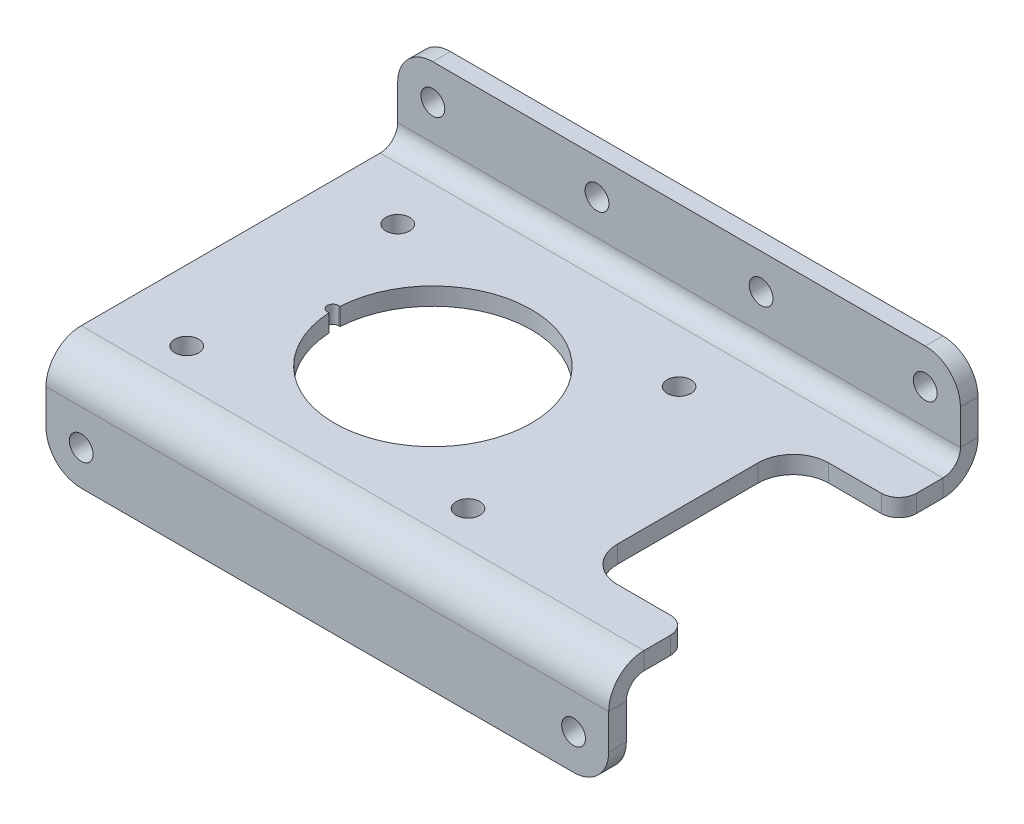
ISO-10303-21;
HEADER;
FILE_DESCRIPTION(('STEP AP214'),'2;1');
FILE_NAME('part.step','',(''),(''),'','','');
FILE_SCHEMA(('AUTOMOTIVE_DESIGN { 1 0 10303 214 1 1 1 1 }'));
ENDSEC;
DATA;
#1=APPLICATION_CONTEXT('core data for automotive mechanical design processes');
#2=APPLICATION_PROTOCOL_DEFINITION('international standard','automotive_design',2000,#1);
#3=PRODUCT_CONTEXT('',#1,'mechanical');
#4=PRODUCT('Part','Part','',(#3));
#5=PRODUCT_RELATED_PRODUCT_CATEGORY('part','',(#4));
#6=PRODUCT_DEFINITION_FORMATION('','',#4);
#7=PRODUCT_DEFINITION_CONTEXT('part definition',#1,'design');
#8=PRODUCT_DEFINITION('design','',#6,#7);
#9=PRODUCT_DEFINITION_SHAPE('','',#8);
#10=(LENGTH_UNIT() NAMED_UNIT(*) SI_UNIT(.MILLI.,.METRE.));
#11=(NAMED_UNIT(*) PLANE_ANGLE_UNIT() SI_UNIT($,.RADIAN.));
#12=(NAMED_UNIT(*) SI_UNIT($,.STERADIAN.) SOLID_ANGLE_UNIT());
#13=UNCERTAINTY_MEASURE_WITH_UNIT(LENGTH_MEASURE(1.E-05),#10,'distance_accuracy_value','');
#14=(GEOMETRIC_REPRESENTATION_CONTEXT(3) GLOBAL_UNCERTAINTY_ASSIGNED_CONTEXT((#13)) GLOBAL_UNIT_ASSIGNED_CONTEXT((#10,
#11,#12)) REPRESENTATION_CONTEXT('',''));
#15=CARTESIAN_POINT('',(0.,0.,0.));
#16=DIRECTION('',(0.,0.,1.));
#17=DIRECTION('',(1.,0.,0.));
#18=AXIS2_PLACEMENT_3D('',#15,#16,#17);
#19=CARTESIAN_POINT('',(101.6,-3.175,-31.75));
#20=DIRECTION('',(1.,0.,0.));
#21=DIRECTION('',(0.,0.,-1.));
#22=AXIS2_PLACEMENT_3D('',#19,#20,#21);
#23=PLANE('',#22);
#24=DIRECTION('',(0.,0.,-1.));
#25=VECTOR('',#24,1.);
#26=CARTESIAN_POINT('',(101.6,-3.175,-31.75));
#27=LINE('',#26,#25);
#28=CARTESIAN_POINT('',(101.6,-3.17500000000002,25.4));
#29=VERTEX_POINT('',#28);
#30=CARTESIAN_POINT('',(101.6,-3.175,20.6375));
#31=VERTEX_POINT('',#30);
#32=EDGE_CURVE('E492',#29,#31,#27,.T.);
#33=ORIENTED_EDGE('',*,*,#32,.T.);
#34=DIRECTION('',(0.,-1.,0.));
#35=VECTOR('',#34,1.);
#36=CARTESIAN_POINT('',(101.6,0.,20.6375));
#37=LINE('',#36,#35);
#38=CARTESIAN_POINT('',(101.6,0.,20.6375));
#39=VERTEX_POINT('',#38);
#40=EDGE_CURVE('E542',#31,#39,#37,.F.);
#41=ORIENTED_EDGE('',*,*,#40,.T.);
#42=DIRECTION('',(0.,0.,-1.));
#43=VECTOR('',#42,1.);
#44=CARTESIAN_POINT('',(101.6,0.,-31.75));
#45=LINE('',#44,#43);
#46=CARTESIAN_POINT('',(101.6,0.,25.4));
#47=VERTEX_POINT('',#46);
#48=EDGE_CURVE('E491',#47,#39,#45,.T.);
#49=ORIENTED_EDGE('',*,*,#48,.F.);
#50=DIRECTION('',(0.,1.,0.));
#51=VECTOR('',#50,1.);
#52=CARTESIAN_POINT('',(101.6,-3.17500000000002,25.4));
#53=LINE('',#52,#51);
#54=EDGE_CURVE('E398',#29,#47,#53,.T.);
#55=ORIENTED_EDGE('',*,*,#54,.F.);
#56=EDGE_LOOP('',(#33,#41,#49,#55));
#57=FACE_BOUND('',#56,.T.);
#58=ADVANCED_FACE('F60',(#57),#23,.T.);
#59=CARTESIAN_POINT('',(0.,-3.175,0.));
#60=DIRECTION('',(0.,1.,0.));
#61=DIRECTION('',(0.,0.,1.));
#62=AXIS2_PLACEMENT_3D('',#59,#60,#61);
#63=PLANE('',#62);
#64=CARTESIAN_POINT('',(12.7,-3.175,19.049999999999));
#65=DIRECTION('',(0.,-1.,0.));
#66=DIRECTION('',(0.,0.,-1.));
#67=AXIS2_PLACEMENT_3D('',#64,#65,#66);
#68=CIRCLE('',#67,2.14999999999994);
#69=CARTESIAN_POINT('',(12.7,-3.175,16.8999999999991));
#70=VERTEX_POINT('',#69);
#71=EDGE_CURVE('E311',#70,#70,#68,.T.);
#72=ORIENTED_EDGE('',*,*,#71,.F.);
#73=EDGE_LOOP('',(#72));
#74=FACE_BOUND('',#73,.T.);
#75=DIRECTION('',(-1.,0.,0.));
#76=VECTOR('',#75,1.);
#77=CARTESIAN_POINT('',(20.3481437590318,-3.175,-1.));
#78=LINE('',#77,#76);
#79=CARTESIAN_POINT('',(20.3481437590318,-3.175,-1.));
#80=VERTEX_POINT('',#79);
#81=CARTESIAN_POINT('',(20.05,-3.175,-1.));
#82=VERTEX_POINT('',#81);
#83=EDGE_CURVE('E465',#80,#82,#78,.T.);
#84=ORIENTED_EDGE('',*,*,#83,.T.);
#85=CARTESIAN_POINT('',(20.05,-3.175,0.));
#86=DIRECTION('',(0.,1.,0.));
#87=DIRECTION('',(0.,0.,1.));
#88=AXIS2_PLACEMENT_3D('',#85,#86,#87);
#89=CIRCLE('',#88,1.);
#90=CARTESIAN_POINT('',(20.05,-3.175,1.));
#91=VERTEX_POINT('',#90);
#92=EDGE_CURVE('E455',#82,#91,#89,.T.);
#93=ORIENTED_EDGE('',*,*,#92,.T.);
#94=DIRECTION('',(1.,0.,0.));
#95=VECTOR('',#94,1.);
#96=CARTESIAN_POINT('',(20.3481437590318,-3.175,0.999999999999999));
#97=LINE('',#96,#95);
#98=CARTESIAN_POINT('',(20.3481437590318,-3.175,0.999999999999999));
#99=VERTEX_POINT('',#98);
#100=EDGE_CURVE('E458',#91,#99,#97,.T.);
#101=ORIENTED_EDGE('',*,*,#100,.T.);
#102=CARTESIAN_POINT('',(38.1,-3.175,0.));
#103=DIRECTION('',(0.,1.,0.));
#104=DIRECTION('',(0.,0.,1.));
#105=AXIS2_PLACEMENT_3D('',#102,#103,#104);
#106=CIRCLE('',#105,17.78);
#107=EDGE_CURVE('E462',#99,#80,#106,.T.);
#108=ORIENTED_EDGE('',*,*,#107,.T.);
#109=EDGE_LOOP('',(#84,#93,#101,#108));
#110=FACE_BOUND('',#109,.T.);
#111=DIRECTION('',(1.,0.,0.));
#112=VECTOR('',#111,1.);
#113=CARTESIAN_POINT('',(0.,-3.175,17.4625));
#114=LINE('',#113,#112);
#115=CARTESIAN_POINT('',(88.9,-3.175,17.4625));
#116=VERTEX_POINT('',#115);
#117=CARTESIAN_POINT('',(98.425,-3.175,17.4625));
#118=VERTEX_POINT('',#117);
#119=EDGE_CURVE('E283',#116,#118,#114,.T.);
#120=ORIENTED_EDGE('',*,*,#119,.T.);
#121=CARTESIAN_POINT('',(98.425,-3.175,20.6375));
#122=DIRECTION('',(0.,1.,0.));
#123=DIRECTION('',(0.,0.,1.));
#124=AXIS2_PLACEMENT_3D('',#121,#122,#123);
#125=CIRCLE('',#124,3.175);
#126=EDGE_CURVE('E540',#118,#31,#125,.F.);
#127=ORIENTED_EDGE('',*,*,#126,.T.);
#128=ORIENTED_EDGE('',*,*,#32,.F.);
#129=DIRECTION('',(-1.,0.,0.));
#130=VECTOR('',#129,1.);
#131=CARTESIAN_POINT('',(0.,-3.17500000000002,25.4));
#132=LINE('',#131,#130);
#133=CARTESIAN_POINT('',(0.,-3.17500000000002,25.4));
#134=VERTEX_POINT('',#133);
#135=EDGE_CURVE('E394',#134,#29,#132,.F.);
#136=ORIENTED_EDGE('',*,*,#135,.F.);
#137=DIRECTION('',(0.,0.,1.));
#138=VECTOR('',#137,1.);
#139=CARTESIAN_POINT('',(0.,-3.175,-31.75));
#140=LINE('',#139,#138);
#141=CARTESIAN_POINT('',(0.,-3.17500000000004,-28.575));
#142=VERTEX_POINT('',#141);
#143=EDGE_CURVE('E487',#142,#134,#140,.T.);
#144=ORIENTED_EDGE('',*,*,#143,.F.);
#145=DIRECTION('',(-1.,0.,0.));
#146=VECTOR('',#145,1.);
#147=CARTESIAN_POINT('',(0.,-3.17500000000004,-28.575));
#148=LINE('',#147,#146);
#149=CARTESIAN_POINT('',(101.6,-3.175,-28.575));
#150=VERTEX_POINT('',#149);
#151=EDGE_CURVE('E431',#142,#150,#148,.F.);
#152=ORIENTED_EDGE('',*,*,#151,.T.);
#153=CARTESIAN_POINT('',(101.6,-3.175,-23.8125));
#154=VERTEX_POINT('',#153);
#155=EDGE_CURVE('E490',#154,#150,#27,.T.);
#156=ORIENTED_EDGE('',*,*,#155,.F.);
#157=CARTESIAN_POINT('',(98.425,-3.175,-23.8125));
#158=DIRECTION('',(0.,1.,0.));
#159=DIRECTION('',(0.,0.,1.));
#160=AXIS2_PLACEMENT_3D('',#157,#158,#159);
#161=CIRCLE('',#160,3.175);
#162=CARTESIAN_POINT('',(98.425,-3.175,-20.6375));
#163=VERTEX_POINT('',#162);
#164=EDGE_CURVE('E538',#154,#163,#161,.F.);
#165=ORIENTED_EDGE('',*,*,#164,.T.);
#166=DIRECTION('',(-1.,0.,0.));
#167=VECTOR('',#166,1.);
#168=CARTESIAN_POINT('',(0.,-3.175,-20.6375));
#169=LINE('',#168,#167);
#170=CARTESIAN_POINT('',(88.9,-3.175,-20.6375));
#171=VERTEX_POINT('',#170);
#172=EDGE_CURVE('E278',#163,#171,#169,.T.);
#173=ORIENTED_EDGE('',*,*,#172,.T.);
#174=CARTESIAN_POINT('',(88.9,-3.175,-14.2875));
#175=DIRECTION('',(0.,1.,0.));
#176=DIRECTION('',(0.,0.,1.));
#177=AXIS2_PLACEMENT_3D('',#174,#175,#176);
#178=CIRCLE('',#177,6.35);
#179=CARTESIAN_POINT('',(82.55,-3.175,-14.2875));
#180=VERTEX_POINT('',#179);
#181=EDGE_CURVE('E258',#171,#180,#178,.T.);
#182=ORIENTED_EDGE('',*,*,#181,.T.);
#183=DIRECTION('',(0.,0.,1.));
#184=VECTOR('',#183,1.);
#185=CARTESIAN_POINT('',(82.55,-3.175,0.));
#186=LINE('',#185,#184);
#187=CARTESIAN_POINT('',(82.55,-3.175,11.1125));
#188=VERTEX_POINT('',#187);
#189=EDGE_CURVE('E287',#180,#188,#186,.T.);
#190=ORIENTED_EDGE('',*,*,#189,.T.);
#191=CARTESIAN_POINT('',(88.9,-3.175,11.1125));
#192=DIRECTION('',(0.,1.,0.));
#193=DIRECTION('',(0.,0.,1.));
#194=AXIS2_PLACEMENT_3D('',#191,#192,#193);
#195=CIRCLE('',#194,6.35);
#196=EDGE_CURVE('E290',#188,#116,#195,.T.);
#197=ORIENTED_EDGE('',*,*,#196,.T.);
#198=EDGE_LOOP('',(#120,#127,#128,#136,#144,#152,#156,#165,#173,#182,#190,#197));
#199=FACE_BOUND('',#198,.T.);
#200=CARTESIAN_POINT('',(63.5,-3.175,19.049999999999));
#201=DIRECTION('',(0.,-1.,0.));
#202=DIRECTION('',(0.,0.,-1.));
#203=AXIS2_PLACEMENT_3D('',#200,#201,#202);
#204=CIRCLE('',#203,2.14999999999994);
#205=CARTESIAN_POINT('',(63.5,-3.175,16.8999999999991));
#206=VERTEX_POINT('',#205);
#207=EDGE_CURVE('E305',#206,#206,#204,.T.);
#208=ORIENTED_EDGE('',*,*,#207,.F.);
#209=EDGE_LOOP('',(#208));
#210=FACE_BOUND('',#209,.T.);
#211=CARTESIAN_POINT('',(63.5,-3.175,-19.049999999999));
#212=DIRECTION('',(0.,-1.,0.));
#213=DIRECTION('',(0.,0.,-1.));
#214=AXIS2_PLACEMENT_3D('',#211,#212,#213);
#215=CIRCLE('',#214,2.14999999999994);
#216=CARTESIAN_POINT('',(63.5,-3.175,-21.1999999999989));
#217=VERTEX_POINT('',#216);
#218=EDGE_CURVE('E299',#217,#217,#215,.T.);
#219=ORIENTED_EDGE('',*,*,#218,.F.);
#220=EDGE_LOOP('',(#219));
#221=FACE_BOUND('',#220,.T.);
#222=CARTESIAN_POINT('',(12.7,-3.175,-19.049999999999));
#223=DIRECTION('',(0.,-1.,0.));
#224=DIRECTION('',(0.,0.,-1.));
#225=AXIS2_PLACEMENT_3D('',#222,#223,#224);
#226=CIRCLE('',#225,2.14999999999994);
#227=CARTESIAN_POINT('',(12.7,-3.175,-21.1999999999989));
#228=VERTEX_POINT('',#227);
#229=EDGE_CURVE('E293',#228,#228,#226,.T.);
#230=ORIENTED_EDGE('',*,*,#229,.F.);
#231=EDGE_LOOP('',(#230));
#232=FACE_BOUND('',#231,.T.);
#233=ADVANCED_FACE('F558',(#74,#110,#199,#210,#221,#232),#63,.F.);
#234=CARTESIAN_POINT('',(0.,-1.22107755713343E-13,-34.925));
#235=DIRECTION('',(0.,0.,1.));
#236=DIRECTION('',(0.,-1.,0.));
#237=AXIS2_PLACEMENT_3D('',#234,#235,#236);
#238=PLANE('',#237);
#239=CARTESIAN_POINT('',(95.25,9.525,-34.925));
#240=DIRECTION('',(0.,0.,-1.));
#241=DIRECTION('',(0.,1.,0.));
#242=AXIS2_PLACEMENT_3D('',#239,#240,#241);
#243=CIRCLE('',#242,2.14999999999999);
#244=CARTESIAN_POINT('',(95.25,11.675,-34.925));
#245=VERTEX_POINT('',#244);
#246=EDGE_CURVE('E317',#245,#245,#243,.T.);
#247=ORIENTED_EDGE('',*,*,#246,.F.);
#248=EDGE_LOOP('',(#247));
#249=FACE_BOUND('',#248,.T.);
#250=CARTESIAN_POINT('',(35.9833333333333,9.525,-34.925));
#251=DIRECTION('',(0.,0.,-1.));
#252=DIRECTION('',(0.,1.,0.));
#253=AXIS2_PLACEMENT_3D('',#250,#251,#252);
#254=CIRCLE('',#253,2.14999999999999);
#255=CARTESIAN_POINT('',(35.9833333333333,11.675,-34.925));
#256=VERTEX_POINT('',#255);
#257=EDGE_CURVE('E335',#256,#256,#254,.T.);
#258=ORIENTED_EDGE('',*,*,#257,.F.);
#259=EDGE_LOOP('',(#258));
#260=FACE_BOUND('',#259,.T.);
#261=DIRECTION('',(1.,0.,0.));
#262=VECTOR('',#261,1.);
#263=CARTESIAN_POINT('',(101.6,15.875,-34.9250000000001));
#264=LINE('',#263,#262);
#265=CARTESIAN_POINT('',(6.34999999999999,15.875,-34.9250000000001));
#266=VERTEX_POINT('',#265);
#267=CARTESIAN_POINT('',(95.25,15.875,-34.9250000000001));
#268=VERTEX_POINT('',#267);
#269=EDGE_CURVE('E421',#266,#268,#264,.T.);
#270=ORIENTED_EDGE('',*,*,#269,.T.);
#271=CARTESIAN_POINT('',(95.25,9.525,-34.925));
#272=DIRECTION('',(0.,0.,1.));
#273=DIRECTION('',(0.,-1.,0.));
#274=AXIS2_PLACEMENT_3D('',#271,#272,#273);
#275=CIRCLE('',#274,6.35);
#276=CARTESIAN_POINT('',(101.6,9.525,-34.925));
#277=VERTEX_POINT('',#276);
#278=EDGE_CURVE('E531',#268,#277,#275,.F.);
#279=ORIENTED_EDGE('',*,*,#278,.T.);
#280=DIRECTION('',(0.,-1.,0.));
#281=VECTOR('',#280,1.);
#282=CARTESIAN_POINT('',(101.6,0.,-34.925));
#283=LINE('',#282,#281);
#284=CARTESIAN_POINT('',(101.6,3.17499999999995,-34.925));
#285=VERTEX_POINT('',#284);
#286=EDGE_CURVE('E415',#277,#285,#283,.T.);
#287=ORIENTED_EDGE('',*,*,#286,.T.);
#288=DIRECTION('',(1.,0.,0.));
#289=VECTOR('',#288,1.);
#290=CARTESIAN_POINT('',(0.,3.17500000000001,-34.925));
#291=LINE('',#290,#289);
#292=CARTESIAN_POINT('',(0.,3.17500000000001,-34.925));
#293=VERTEX_POINT('',#292);
#294=EDGE_CURVE('E409',#293,#285,#291,.T.);
#295=ORIENTED_EDGE('',*,*,#294,.F.);
#296=DIRECTION('',(0.,1.,0.));
#297=VECTOR('',#296,1.);
#298=CARTESIAN_POINT('',(0.,15.875,-34.9250000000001));
#299=LINE('',#298,#297);
#300=CARTESIAN_POINT('',(0.,9.525,-34.925));
#301=VERTEX_POINT('',#300);
#302=EDGE_CURVE('E417',#293,#301,#299,.T.);
#303=ORIENTED_EDGE('',*,*,#302,.T.);
#304=CARTESIAN_POINT('',(6.34999999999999,9.525,-34.925));
#305=DIRECTION('',(0.,0.,1.));
#306=DIRECTION('',(0.,-1.,0.));
#307=AXIS2_PLACEMENT_3D('',#304,#305,#306);
#308=CIRCLE('',#307,6.35);
#309=EDGE_CURVE('E529',#301,#266,#308,.F.);
#310=ORIENTED_EDGE('',*,*,#309,.T.);
#311=EDGE_LOOP('',(#270,#279,#287,#295,#303,#310));
#312=FACE_BOUND('',#311,.T.);
#313=CARTESIAN_POINT('',(65.6166666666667,9.525,-34.925));
#314=DIRECTION('',(0.,0.,-1.));
#315=DIRECTION('',(0.,1.,0.));
#316=AXIS2_PLACEMENT_3D('',#313,#314,#315);
#317=CIRCLE('',#316,2.14999999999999);
#318=CARTESIAN_POINT('',(65.6166666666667,11.675,-34.925));
#319=VERTEX_POINT('',#318);
#320=EDGE_CURVE('E329',#319,#319,#317,.T.);
#321=ORIENTED_EDGE('',*,*,#320,.F.);
#322=EDGE_LOOP('',(#321));
#323=FACE_BOUND('',#322,.T.);
#324=CARTESIAN_POINT('',(6.34999999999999,9.525,-34.925));
#325=DIRECTION('',(0.,0.,-1.));
#326=DIRECTION('',(0.,1.,0.));
#327=AXIS2_PLACEMENT_3D('',#324,#325,#326);
#328=CIRCLE('',#327,2.14999999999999);
#329=CARTESIAN_POINT('',(6.34999999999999,11.675,-34.925));
#330=VERTEX_POINT('',#329);
#331=EDGE_CURVE('E323',#330,#330,#328,.T.);
#332=ORIENTED_EDGE('',*,*,#331,.F.);
#333=EDGE_LOOP('',(#332));
#334=FACE_BOUND('',#333,.T.);
#335=ADVANCED_FACE('F616',(#249,#260,#312,#323,#334),#238,.F.);
#336=CARTESIAN_POINT('',(0.,-3.175,-31.75));
#337=DIRECTION('',(-1.,0.,0.));
#338=DIRECTION('',(0.,0.,1.));
#339=AXIS2_PLACEMENT_3D('',#336,#337,#338);
#340=PLANE('',#339);
#341=ORIENTED_EDGE('',*,*,#143,.T.);
#342=DIRECTION('',(0.,1.,0.));
#343=VECTOR('',#342,1.);
#344=CARTESIAN_POINT('',(0.,-3.17500000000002,25.4));
#345=LINE('',#344,#343);
#346=CARTESIAN_POINT('',(0.,0.,25.4));
#347=VERTEX_POINT('',#346);
#348=EDGE_CURVE('E388',#134,#347,#345,.T.);
#349=ORIENTED_EDGE('',*,*,#348,.T.);
#350=DIRECTION('',(0.,0.,1.));
#351=VECTOR('',#350,1.);
#352=CARTESIAN_POINT('',(0.,0.,-31.75));
#353=LINE('',#352,#351);
#354=CARTESIAN_POINT('',(0.,0.,-28.575));
#355=VERTEX_POINT('',#354);
#356=EDGE_CURVE('E480',#355,#347,#353,.T.);
#357=ORIENTED_EDGE('',*,*,#356,.F.);
#358=DIRECTION('',(0.,-1.,0.));
#359=VECTOR('',#358,1.);
#360=CARTESIAN_POINT('',(0.,0.,-28.575));
#361=LINE('',#360,#359);
#362=EDGE_CURVE('E438',#355,#142,#361,.T.);
#363=ORIENTED_EDGE('',*,*,#362,.T.);
#364=EDGE_LOOP('',(#341,#349,#357,#363));
#365=FACE_BOUND('',#364,.T.);
#366=ADVANCED_FACE('F631',(#365),#340,.T.);
#367=CARTESIAN_POINT('',(0.,0.,0.));
#368=DIRECTION('',(0.,1.,0.));
#369=DIRECTION('',(0.,0.,1.));
#370=AXIS2_PLACEMENT_3D('',#367,#368,#369);
#371=PLANE('',#370);
#372=ORIENTED_EDGE('',*,*,#48,.T.);
#373=CARTESIAN_POINT('',(98.425,0.,20.6375));
#374=DIRECTION('',(0.,1.,0.));
#375=DIRECTION('',(0.,0.,1.));
#376=AXIS2_PLACEMENT_3D('',#373,#374,#375);
#377=CIRCLE('',#376,3.175);
#378=CARTESIAN_POINT('',(98.425,0.,17.4625));
#379=VERTEX_POINT('',#378);
#380=EDGE_CURVE('E545',#39,#379,#377,.T.);
#381=ORIENTED_EDGE('',*,*,#380,.T.);
#382=DIRECTION('',(1.,0.,0.));
#383=VECTOR('',#382,1.);
#384=CARTESIAN_POINT('',(101.6,0.,17.4625));
#385=LINE('',#384,#383);
#386=CARTESIAN_POINT('',(88.9,0.,17.4625));
#387=VERTEX_POINT('',#386);
#388=EDGE_CURVE('E260',#387,#379,#385,.T.);
#389=ORIENTED_EDGE('',*,*,#388,.F.);
#390=CARTESIAN_POINT('',(88.9,0.,11.1125));
#391=DIRECTION('',(0.,1.,0.));
#392=DIRECTION('',(1.,0.,0.));
#393=AXIS2_PLACEMENT_3D('',#390,#391,#392);
#394=CIRCLE('',#393,6.35);
#395=CARTESIAN_POINT('',(82.55,0.,11.1125));
#396=VERTEX_POINT('',#395);
#397=EDGE_CURVE('E269',#396,#387,#394,.T.);
#398=ORIENTED_EDGE('',*,*,#397,.F.);
#399=DIRECTION('',(0.,0.,1.));
#400=VECTOR('',#399,1.);
#401=CARTESIAN_POINT('',(82.55,0.,-14.2875));
#402=LINE('',#401,#400);
#403=CARTESIAN_POINT('',(82.55,0.,-14.2875));
#404=VERTEX_POINT('',#403);
#405=EDGE_CURVE('E267',#404,#396,#402,.T.);
#406=ORIENTED_EDGE('',*,*,#405,.F.);
#407=CARTESIAN_POINT('',(88.9,0.,-14.2875));
#408=DIRECTION('',(0.,1.,0.));
#409=DIRECTION('',(-1.,0.,0.));
#410=AXIS2_PLACEMENT_3D('',#407,#408,#409);
#411=CIRCLE('',#410,6.35);
#412=CARTESIAN_POINT('',(88.9,0.,-20.6375));
#413=VERTEX_POINT('',#412);
#414=EDGE_CURVE('E249',#413,#404,#411,.T.);
#415=ORIENTED_EDGE('',*,*,#414,.F.);
#416=DIRECTION('',(-1.,0.,0.));
#417=VECTOR('',#416,1.);
#418=CARTESIAN_POINT('',(101.6,0.,-20.6375));
#419=LINE('',#418,#417);
#420=CARTESIAN_POINT('',(98.425,0.,-20.6375));
#421=VERTEX_POINT('',#420);
#422=EDGE_CURVE('E243',#421,#413,#419,.T.);
#423=ORIENTED_EDGE('',*,*,#422,.F.);
#424=CARTESIAN_POINT('',(98.425,0.,-23.8125));
#425=DIRECTION('',(0.,1.,0.));
#426=DIRECTION('',(0.,0.,1.));
#427=AXIS2_PLACEMENT_3D('',#424,#425,#426);
#428=CIRCLE('',#427,3.175);
#429=CARTESIAN_POINT('',(101.6,0.,-23.8125));
#430=VERTEX_POINT('',#429);
#431=EDGE_CURVE('E75',#421,#430,#428,.T.);
#432=ORIENTED_EDGE('',*,*,#431,.T.);
#433=CARTESIAN_POINT('',(101.6,0.,-28.575));
#434=VERTEX_POINT('',#433);
#435=EDGE_CURVE('E498',#430,#434,#45,.T.);
#436=ORIENTED_EDGE('',*,*,#435,.T.);
#437=DIRECTION('',(-1.,0.,0.));
#438=VECTOR('',#437,1.);
#439=CARTESIAN_POINT('',(0.,0.,-28.575));
#440=LINE('',#439,#438);
#441=EDGE_CURVE('E444',#355,#434,#440,.F.);
#442=ORIENTED_EDGE('',*,*,#441,.F.);
#443=ORIENTED_EDGE('',*,*,#356,.T.);
#444=DIRECTION('',(-1.,0.,0.));
#445=VECTOR('',#444,1.);
#446=CARTESIAN_POINT('',(0.,0.,25.4));
#447=LINE('',#446,#445);
#448=EDGE_CURVE('E381',#347,#47,#447,.F.);
#449=ORIENTED_EDGE('',*,*,#448,.T.);
#450=EDGE_LOOP('',(#372,#381,#389,#398,#406,#415,#423,#432,#436,#442,#443,#449));
#451=FACE_BOUND('',#450,.T.);
#452=CARTESIAN_POINT('',(12.7,0.,-19.049999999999));
#453=DIRECTION('',(0.,1.,0.));
#454=DIRECTION('',(0.,0.,1.));
#455=AXIS2_PLACEMENT_3D('',#452,#453,#454);
#456=CIRCLE('',#455,2.14999999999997);
#457=CARTESIAN_POINT('',(12.7,0.,-16.899999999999));
#458=VERTEX_POINT('',#457);
#459=EDGE_CURVE('E296',#458,#458,#456,.T.);
#460=ORIENTED_EDGE('',*,*,#459,.F.);
#461=EDGE_LOOP('',(#460));
#462=FACE_BOUND('',#461,.T.);
#463=CARTESIAN_POINT('',(63.5,0.,-19.049999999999));
#464=DIRECTION('',(0.,1.,0.));
#465=DIRECTION('',(0.,0.,1.));
#466=AXIS2_PLACEMENT_3D('',#463,#464,#465);
#467=CIRCLE('',#466,2.14999999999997);
#468=CARTESIAN_POINT('',(63.5,0.,-16.899999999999));
#469=VERTEX_POINT('',#468);
#470=EDGE_CURVE('E302',#469,#469,#467,.T.);
#471=ORIENTED_EDGE('',*,*,#470,.F.);
#472=EDGE_LOOP('',(#471));
#473=FACE_BOUND('',#472,.T.);
#474=CARTESIAN_POINT('',(63.5,0.,19.049999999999));
#475=DIRECTION('',(0.,1.,0.));
#476=DIRECTION('',(0.,0.,1.));
#477=AXIS2_PLACEMENT_3D('',#474,#475,#476);
#478=CIRCLE('',#477,2.14999999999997);
#479=CARTESIAN_POINT('',(63.5,0.,21.199999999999));
#480=VERTEX_POINT('',#479);
#481=EDGE_CURVE('E308',#480,#480,#478,.T.);
#482=ORIENTED_EDGE('',*,*,#481,.F.);
#483=EDGE_LOOP('',(#482));
#484=FACE_BOUND('',#483,.T.);
#485=CARTESIAN_POINT('',(12.7,0.,19.049999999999));
#486=DIRECTION('',(0.,1.,0.));
#487=DIRECTION('',(0.,0.,1.));
#488=AXIS2_PLACEMENT_3D('',#485,#486,#487);
#489=CIRCLE('',#488,2.14999999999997);
#490=CARTESIAN_POINT('',(12.7,0.,21.199999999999));
#491=VERTEX_POINT('',#490);
#492=EDGE_CURVE('E314',#491,#491,#489,.T.);
#493=ORIENTED_EDGE('',*,*,#492,.F.);
#494=EDGE_LOOP('',(#493));
#495=FACE_BOUND('',#494,.T.);
#496=CARTESIAN_POINT('',(20.05,0.,0.));
#497=DIRECTION('',(0.,1.,0.));
#498=DIRECTION('',(0.,0.,1.));
#499=AXIS2_PLACEMENT_3D('',#496,#497,#498);
#500=CIRCLE('',#499,1.);
#501=CARTESIAN_POINT('',(20.05,0.,-1.));
#502=VERTEX_POINT('',#501);
#503=CARTESIAN_POINT('',(20.05,0.,1.));
#504=VERTEX_POINT('',#503);
#505=EDGE_CURVE('E452',#502,#504,#500,.T.);
#506=ORIENTED_EDGE('',*,*,#505,.F.);
#507=DIRECTION('',(-1.,0.,0.));
#508=VECTOR('',#507,1.);
#509=CARTESIAN_POINT('',(20.3481437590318,0.,-1.));
#510=LINE('',#509,#508);
#511=CARTESIAN_POINT('',(20.3481437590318,0.,-1.));
#512=VERTEX_POINT('',#511);
#513=EDGE_CURVE('E459',#512,#502,#510,.T.);
#514=ORIENTED_EDGE('',*,*,#513,.F.);
#515=CARTESIAN_POINT('',(38.1,0.,0.));
#516=DIRECTION('',(0.,1.,0.));
#517=DIRECTION('',(0.,0.,1.));
#518=AXIS2_PLACEMENT_3D('',#515,#516,#517);
#519=CIRCLE('',#518,17.78);
#520=CARTESIAN_POINT('',(20.3481437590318,0.,0.999999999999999));
#521=VERTEX_POINT('',#520);
#522=EDGE_CURVE('E473',#521,#512,#519,.T.);
#523=ORIENTED_EDGE('',*,*,#522,.F.);
#524=DIRECTION('',(1.,0.,0.));
#525=VECTOR('',#524,1.);
#526=CARTESIAN_POINT('',(20.3481437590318,0.,0.999999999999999));
#527=LINE('',#526,#525);
#528=EDGE_CURVE('E470',#504,#521,#527,.T.);
#529=ORIENTED_EDGE('',*,*,#528,.F.);
#530=EDGE_LOOP('',(#506,#514,#523,#529));
#531=FACE_BOUND('',#530,.T.);
#532=ADVANCED_FACE('F263',(#451,#462,#473,#484,#495,#531),#371,.T.);
#533=ORIENTED_EDGE('',*,*,#435,.F.);
#534=DIRECTION('',(0.,1.,0.));
#535=VECTOR('',#534,1.);
#536=CARTESIAN_POINT('',(101.6,-3.175,-23.8125));
#537=LINE('',#536,#535);
#538=EDGE_CURVE('E13',#430,#154,#537,.F.);
#539=ORIENTED_EDGE('',*,*,#538,.T.);
#540=ORIENTED_EDGE('',*,*,#155,.T.);
#541=DIRECTION('',(0.,-1.,0.));
#542=VECTOR('',#541,1.);
#543=CARTESIAN_POINT('',(101.6,0.,-28.575));
#544=LINE('',#543,#542);
#545=EDGE_CURVE('E449',#434,#150,#544,.T.);
#546=ORIENTED_EDGE('',*,*,#545,.F.);
#547=EDGE_LOOP('',(#533,#539,#540,#546));
#548=FACE_BOUND('',#547,.T.);
#549=ADVANCED_FACE('F612',(#548),#23,.T.);
#550=CARTESIAN_POINT('',(20.05,-3.175,0.));
#551=DIRECTION('',(0.,1.,0.));
#552=DIRECTION('',(0.,0.,1.));
#553=AXIS2_PLACEMENT_3D('',#550,#551,#552);
#554=CYLINDRICAL_SURFACE('',#553,1.);
#555=ORIENTED_EDGE('',*,*,#505,.T.);
#556=DIRECTION('',(0.,1.,0.));
#557=VECTOR('',#556,1.);
#558=CARTESIAN_POINT('',(20.05,-3.175,1.));
#559=LINE('',#558,#557);
#560=EDGE_CURVE('E468',#91,#504,#559,.T.);
#561=ORIENTED_EDGE('',*,*,#560,.F.);
#562=ORIENTED_EDGE('',*,*,#92,.F.);
#563=DIRECTION('',(0.,1.,0.));
#564=VECTOR('',#563,1.);
#565=CARTESIAN_POINT('',(20.05,-3.175,-1.));
#566=LINE('',#565,#564);
#567=EDGE_CURVE('E478',#82,#502,#566,.T.);
#568=ORIENTED_EDGE('',*,*,#567,.T.);
#569=EDGE_LOOP('',(#555,#561,#562,#568));
#570=FACE_BOUND('',#569,.T.);
#571=ADVANCED_FACE('F622',(#570),#554,.F.);
#572=CARTESIAN_POINT('',(20.3481437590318,-3.175,-1.));
#573=DIRECTION('',(0.,0.,-1.));
#574=DIRECTION('',(-1.,0.,0.));
#575=AXIS2_PLACEMENT_3D('',#572,#573,#574);
#576=PLANE('',#575);
#577=ORIENTED_EDGE('',*,*,#513,.T.);
#578=ORIENTED_EDGE('',*,*,#567,.F.);
#579=ORIENTED_EDGE('',*,*,#83,.F.);
#580=DIRECTION('',(0.,1.,0.));
#581=VECTOR('',#580,1.);
#582=CARTESIAN_POINT('',(20.3481437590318,-3.175,-1.));
#583=LINE('',#582,#581);
#584=EDGE_CURVE('E481',#80,#512,#583,.T.);
#585=ORIENTED_EDGE('',*,*,#584,.T.);
#586=EDGE_LOOP('',(#577,#578,#579,#585));
#587=FACE_BOUND('',#586,.T.);
#588=ADVANCED_FACE('F628',(#587),#576,.F.);
#589=CARTESIAN_POINT('',(38.1,-3.175,0.));
#590=DIRECTION('',(0.,1.,0.));
#591=DIRECTION('',(0.,0.,1.));
#592=AXIS2_PLACEMENT_3D('',#589,#590,#591);
#593=CYLINDRICAL_SURFACE('',#592,17.78);
#594=ORIENTED_EDGE('',*,*,#522,.T.);
#595=ORIENTED_EDGE('',*,*,#584,.F.);
#596=ORIENTED_EDGE('',*,*,#107,.F.);
#597=DIRECTION('',(0.,1.,0.));
#598=VECTOR('',#597,1.);
#599=CARTESIAN_POINT('',(20.3481437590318,-3.175,0.999999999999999));
#600=LINE('',#599,#598);
#601=EDGE_CURVE('E483',#99,#521,#600,.T.);
#602=ORIENTED_EDGE('',*,*,#601,.T.);
#603=EDGE_LOOP('',(#594,#595,#596,#602));
#604=FACE_BOUND('',#603,.T.);
#605=ADVANCED_FACE('F704',(#604),#593,.F.);
#606=CARTESIAN_POINT('',(20.3481437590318,-3.175,0.999999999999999));
#607=DIRECTION('',(0.,0.,1.));
#608=DIRECTION('',(1.,0.,0.));
#609=AXIS2_PLACEMENT_3D('',#606,#607,#608);
#610=PLANE('',#609);
#611=ORIENTED_EDGE('',*,*,#528,.T.);
#612=ORIENTED_EDGE('',*,*,#601,.F.);
#613=ORIENTED_EDGE('',*,*,#100,.F.);
#614=ORIENTED_EDGE('',*,*,#560,.T.);
#615=EDGE_LOOP('',(#611,#612,#613,#614));
#616=FACE_BOUND('',#615,.T.);
#617=ADVANCED_FACE('F698',(#616),#610,.F.);
#618=CARTESIAN_POINT('',(101.6,3.17499999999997,-28.575));
#619=DIRECTION('',(1.,0.,0.));
#620=DIRECTION('',(0.,1.,0.));
#621=AXIS2_PLACEMENT_3D('',#618,#619,#620);
#622=PLANE('',#621);
#623=DIRECTION('',(0.,0.,-1.));
#624=VECTOR('',#623,1.);
#625=CARTESIAN_POINT('',(101.6,3.17499999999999,-31.75));
#626=LINE('',#625,#624);
#627=CARTESIAN_POINT('',(101.6,3.17499999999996,-31.75));
#628=VERTEX_POINT('',#627);
#629=EDGE_CURVE('E401',#628,#285,#626,.T.);
#630=ORIENTED_EDGE('',*,*,#629,.F.);
#631=CARTESIAN_POINT('',(101.6,3.17499999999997,-28.575));
#632=DIRECTION('',(-1.,0.,0.));
#633=DIRECTION('',(0.,-1.,0.));
#634=AXIS2_PLACEMENT_3D('',#631,#632,#633);
#635=CIRCLE('',#634,3.175);
#636=EDGE_CURVE('E441',#434,#628,#635,.F.);
#637=ORIENTED_EDGE('',*,*,#636,.F.);
#638=ORIENTED_EDGE('',*,*,#545,.T.);
#639=CARTESIAN_POINT('',(101.6,3.17499999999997,-28.575));
#640=DIRECTION('',(-1.,0.,0.));
#641=DIRECTION('',(0.,-1.,0.));
#642=AXIS2_PLACEMENT_3D('',#639,#640,#641);
#643=CIRCLE('',#642,6.35);
#644=EDGE_CURVE('E434',#150,#285,#643,.F.);
#645=ORIENTED_EDGE('',*,*,#644,.T.);
#646=EDGE_LOOP('',(#630,#637,#638,#645));
#647=FACE_BOUND('',#646,.T.);
#648=ADVANCED_FACE('F641',(#647),#622,.T.);
#649=CARTESIAN_POINT('',(0.,3.17499999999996,-28.575));
#650=DIRECTION('',(1.,0.,0.));
#651=DIRECTION('',(0.,1.,0.));
#652=AXIS2_PLACEMENT_3D('',#649,#650,#651);
#653=PLANE('',#652);
#654=CARTESIAN_POINT('',(0.,3.17499999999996,-28.575));
#655=DIRECTION('',(-1.,0.,0.));
#656=DIRECTION('',(0.,-1.,0.));
#657=AXIS2_PLACEMENT_3D('',#654,#655,#656);
#658=CIRCLE('',#657,3.175);
#659=CARTESIAN_POINT('',(0.,3.17499999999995,-31.75));
#660=VERTEX_POINT('',#659);
#661=EDGE_CURVE('E424',#660,#355,#658,.T.);
#662=ORIENTED_EDGE('',*,*,#661,.F.);
#663=DIRECTION('',(0.,0.,-1.));
#664=VECTOR('',#663,1.);
#665=CARTESIAN_POINT('',(0.,3.17499999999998,-31.75));
#666=LINE('',#665,#664);
#667=EDGE_CURVE('E406',#660,#293,#666,.T.);
#668=ORIENTED_EDGE('',*,*,#667,.T.);
#669=CARTESIAN_POINT('',(0.,3.17499999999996,-28.575));
#670=DIRECTION('',(-1.,0.,0.));
#671=DIRECTION('',(0.,-1.,0.));
#672=AXIS2_PLACEMENT_3D('',#669,#670,#671);
#673=CIRCLE('',#672,6.35);
#674=EDGE_CURVE('E435',#293,#142,#673,.T.);
#675=ORIENTED_EDGE('',*,*,#674,.T.);
#676=ORIENTED_EDGE('',*,*,#362,.F.);
#677=EDGE_LOOP('',(#662,#668,#675,#676));
#678=FACE_BOUND('',#677,.T.);
#679=ADVANCED_FACE('F693',(#678),#653,.F.);
#680=CARTESIAN_POINT('',(0.,3.17499999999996,-28.575));
#681=DIRECTION('',(-1.,0.,0.));
#682=DIRECTION('',(0.,0.,-1.));
#683=AXIS2_PLACEMENT_3D('',#680,#681,#682);
#684=CYLINDRICAL_SURFACE('',#683,6.35);
#685=ORIENTED_EDGE('',*,*,#151,.F.);
#686=ORIENTED_EDGE('',*,*,#674,.F.);
#687=ORIENTED_EDGE('',*,*,#294,.T.);
#688=ORIENTED_EDGE('',*,*,#644,.F.);
#689=EDGE_LOOP('',(#685,#686,#687,#688));
#690=FACE_BOUND('',#689,.T.);
#691=ADVANCED_FACE('F642',(#690),#684,.T.);
#692=CARTESIAN_POINT('',(0.,3.17499999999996,-28.575));
#693=DIRECTION('',(-1.,0.,0.));
#694=DIRECTION('',(0.,0.,-1.));
#695=AXIS2_PLACEMENT_3D('',#692,#693,#694);
#696=CYLINDRICAL_SURFACE('',#695,3.175);
#697=ORIENTED_EDGE('',*,*,#441,.T.);
#698=ORIENTED_EDGE('',*,*,#636,.T.);
#699=DIRECTION('',(-1.,0.,0.));
#700=VECTOR('',#699,1.);
#701=CARTESIAN_POINT('',(101.6,3.17499999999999,-31.75));
#702=LINE('',#701,#700);
#703=EDGE_CURVE('E404',#628,#660,#702,.T.);
#704=ORIENTED_EDGE('',*,*,#703,.T.);
#705=ORIENTED_EDGE('',*,*,#661,.T.);
#706=EDGE_LOOP('',(#697,#698,#704,#705));
#707=FACE_BOUND('',#706,.T.);
#708=ADVANCED_FACE('F671',(#707),#696,.F.);
#709=CARTESIAN_POINT('',(101.6,0.,-34.925));
#710=DIRECTION('',(-1.,0.,0.));
#711=DIRECTION('',(0.,0.,1.));
#712=AXIS2_PLACEMENT_3D('',#709,#710,#711);
#713=PLANE('',#712);
#714=ORIENTED_EDGE('',*,*,#286,.F.);
#715=DIRECTION('',(0.,0.,1.));
#716=VECTOR('',#715,1.);
#717=CARTESIAN_POINT('',(101.6,9.525,-34.925));
#718=LINE('',#717,#716);
#719=CARTESIAN_POINT('',(101.6,9.52500000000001,-31.75));
#720=VERTEX_POINT('',#719);
#721=EDGE_CURVE('E517',#277,#720,#718,.T.);
#722=ORIENTED_EDGE('',*,*,#721,.T.);
#723=DIRECTION('',(0.,-1.,0.));
#724=VECTOR('',#723,1.);
#725=CARTESIAN_POINT('',(101.6,0.,-31.75));
#726=LINE('',#725,#724);
#727=EDGE_CURVE('E414',#720,#628,#726,.T.);
#728=ORIENTED_EDGE('',*,*,#727,.T.);
#729=ORIENTED_EDGE('',*,*,#629,.T.);
#730=EDGE_LOOP('',(#714,#722,#728,#729));
#731=FACE_BOUND('',#730,.T.);
#732=ADVANCED_FACE('F667',(#731),#713,.F.);
#733=CARTESIAN_POINT('',(0.,15.875,-34.9250000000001));
#734=DIRECTION('',(1.,0.,0.));
#735=DIRECTION('',(0.,1.,0.));
#736=AXIS2_PLACEMENT_3D('',#733,#734,#735);
#737=PLANE('',#736);
#738=DIRECTION('',(0.,1.,0.));
#739=VECTOR('',#738,1.);
#740=CARTESIAN_POINT('',(0.,15.875,-31.7500000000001));
#741=LINE('',#740,#739);
#742=CARTESIAN_POINT('',(0.,9.52500000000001,-31.75));
#743=VERTEX_POINT('',#742);
#744=EDGE_CURVE('E426',#660,#743,#741,.T.);
#745=ORIENTED_EDGE('',*,*,#744,.T.);
#746=DIRECTION('',(0.,0.,1.));
#747=VECTOR('',#746,1.);
#748=CARTESIAN_POINT('',(0.,9.525,-34.925));
#749=LINE('',#748,#747);
#750=EDGE_CURVE('E533',#743,#301,#749,.F.);
#751=ORIENTED_EDGE('',*,*,#750,.T.);
#752=ORIENTED_EDGE('',*,*,#302,.F.);
#753=ORIENTED_EDGE('',*,*,#667,.F.);
#754=EDGE_LOOP('',(#745,#751,#752,#753));
#755=FACE_BOUND('',#754,.T.);
#756=ADVANCED_FACE('F651',(#755),#737,.F.);
#757=CARTESIAN_POINT('',(0.,-1.11022302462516E-13,-31.75));
#758=DIRECTION('',(0.,0.,1.));
#759=DIRECTION('',(0.,-1.,0.));
#760=AXIS2_PLACEMENT_3D('',#757,#758,#759);
#761=PLANE('',#760);
#762=CARTESIAN_POINT('',(95.25,9.52500000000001,-31.75));
#763=DIRECTION('',(0.,0.,1.));
#764=DIRECTION('',(0.,-1.,0.));
#765=AXIS2_PLACEMENT_3D('',#762,#763,#764);
#766=CIRCLE('',#765,2.14999999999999);
#767=CARTESIAN_POINT('',(95.25,7.37500000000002,-31.75));
#768=VERTEX_POINT('',#767);
#769=EDGE_CURVE('E320',#768,#768,#766,.T.);
#770=ORIENTED_EDGE('',*,*,#769,.F.);
#771=EDGE_LOOP('',(#770));
#772=FACE_BOUND('',#771,.T.);
#773=CARTESIAN_POINT('',(6.34999999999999,9.52500000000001,-31.75));
#774=DIRECTION('',(0.,0.,1.));
#775=DIRECTION('',(0.,-1.,0.));
#776=AXIS2_PLACEMENT_3D('',#773,#774,#775);
#777=CIRCLE('',#776,2.14999999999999);
#778=CARTESIAN_POINT('',(6.34999999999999,7.37500000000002,-31.75));
#779=VERTEX_POINT('',#778);
#780=EDGE_CURVE('E326',#779,#779,#777,.T.);
#781=ORIENTED_EDGE('',*,*,#780,.F.);
#782=EDGE_LOOP('',(#781));
#783=FACE_BOUND('',#782,.T.);
#784=CARTESIAN_POINT('',(65.6166666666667,9.52500000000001,-31.75));
#785=DIRECTION('',(0.,0.,1.));
#786=DIRECTION('',(0.,-1.,0.));
#787=AXIS2_PLACEMENT_3D('',#784,#785,#786);
#788=CIRCLE('',#787,2.14999999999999);
#789=CARTESIAN_POINT('',(65.6166666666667,7.37500000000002,-31.75));
#790=VERTEX_POINT('',#789);
#791=EDGE_CURVE('E332',#790,#790,#788,.T.);
#792=ORIENTED_EDGE('',*,*,#791,.F.);
#793=EDGE_LOOP('',(#792));
#794=FACE_BOUND('',#793,.T.);
#795=CARTESIAN_POINT('',(35.9833333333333,9.52500000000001,-31.75));
#796=DIRECTION('',(0.,0.,1.));
#797=DIRECTION('',(0.,-1.,0.));
#798=AXIS2_PLACEMENT_3D('',#795,#796,#797);
#799=CIRCLE('',#798,2.14999999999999);
#800=CARTESIAN_POINT('',(35.9833333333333,7.37500000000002,-31.75));
#801=VERTEX_POINT('',#800);
#802=EDGE_CURVE('E338',#801,#801,#799,.T.);
#803=ORIENTED_EDGE('',*,*,#802,.F.);
#804=EDGE_LOOP('',(#803));
#805=FACE_BOUND('',#804,.T.);
#806=ORIENTED_EDGE('',*,*,#727,.F.);
#807=CARTESIAN_POINT('',(95.25,9.52500000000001,-31.75));
#808=DIRECTION('',(0.,0.,1.));
#809=DIRECTION('',(0.,-1.,0.));
#810=AXIS2_PLACEMENT_3D('',#807,#808,#809);
#811=CIRCLE('',#810,6.35);
#812=CARTESIAN_POINT('',(95.25,15.875,-31.7500000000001));
#813=VERTEX_POINT('',#812);
#814=EDGE_CURVE('E522',#720,#813,#811,.T.);
#815=ORIENTED_EDGE('',*,*,#814,.T.);
#816=DIRECTION('',(1.,0.,0.));
#817=VECTOR('',#816,1.);
#818=CARTESIAN_POINT('',(101.6,15.875,-31.7500000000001));
#819=LINE('',#818,#817);
#820=CARTESIAN_POINT('',(6.34999999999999,15.875,-31.7500000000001));
#821=VERTEX_POINT('',#820);
#822=EDGE_CURVE('E418',#821,#813,#819,.T.);
#823=ORIENTED_EDGE('',*,*,#822,.F.);
#824=CARTESIAN_POINT('',(6.34999999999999,9.52500000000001,-31.75));
#825=DIRECTION('',(0.,0.,1.));
#826=DIRECTION('',(0.,-1.,0.));
#827=AXIS2_PLACEMENT_3D('',#824,#825,#826);
#828=CIRCLE('',#827,6.35);
#829=EDGE_CURVE('E520',#821,#743,#828,.T.);
#830=ORIENTED_EDGE('',*,*,#829,.T.);
#831=ORIENTED_EDGE('',*,*,#744,.F.);
#832=ORIENTED_EDGE('',*,*,#703,.F.);
#833=EDGE_LOOP('',(#806,#815,#823,#830,#831,#832));
#834=FACE_BOUND('',#833,.T.);
#835=ADVANCED_FACE('F674',(#772,#783,#794,#805,#834),#761,.T.);
#836=CARTESIAN_POINT('',(101.6,15.875,-34.9250000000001));
#837=DIRECTION('',(0.,-1.,0.));
#838=DIRECTION('',(0.,0.,-1.));
#839=AXIS2_PLACEMENT_3D('',#836,#837,#838);
#840=PLANE('',#839);
#841=ORIENTED_EDGE('',*,*,#822,.T.);
#842=DIRECTION('',(0.,0.,1.));
#843=VECTOR('',#842,1.);
#844=CARTESIAN_POINT('',(95.25,15.875,-34.9250000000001));
#845=LINE('',#844,#843);
#846=EDGE_CURVE('E527',#813,#268,#845,.F.);
#847=ORIENTED_EDGE('',*,*,#846,.T.);
#848=ORIENTED_EDGE('',*,*,#269,.F.);
#849=DIRECTION('',(0.,0.,1.));
#850=VECTOR('',#849,1.);
#851=CARTESIAN_POINT('',(6.34999999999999,15.875,-34.9250000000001));
#852=LINE('',#851,#850);
#853=EDGE_CURVE('E524',#266,#821,#852,.T.);
#854=ORIENTED_EDGE('',*,*,#853,.T.);
#855=EDGE_LOOP('',(#841,#847,#848,#854));
#856=FACE_BOUND('',#855,.T.);
#857=ADVANCED_FACE('F660',(#856),#840,.F.);
#858=CARTESIAN_POINT('',(101.6,-6.34999999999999,25.4));
#859=DIRECTION('',(1.,0.,0.));
#860=DIRECTION('',(0.,0.,-1.));
#861=AXIS2_PLACEMENT_3D('',#858,#859,#860);
#862=PLANE('',#861);
#863=DIRECTION('',(0.,0.,-1.));
#864=VECTOR('',#863,1.);
#865=CARTESIAN_POINT('',(101.6,-6.34999999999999,31.7499999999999));
#866=LINE('',#865,#864);
#867=CARTESIAN_POINT('',(101.6,-6.34999999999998,28.5749999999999));
#868=VERTEX_POINT('',#867);
#869=CARTESIAN_POINT('',(101.6,-6.34999999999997,31.75));
#870=VERTEX_POINT('',#869);
#871=EDGE_CURVE('E353',#868,#870,#866,.F.);
#872=ORIENTED_EDGE('',*,*,#871,.F.);
#873=CARTESIAN_POINT('',(101.6,-6.34999999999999,25.4));
#874=DIRECTION('',(-1.,0.,0.));
#875=DIRECTION('',(0.,0.,1.));
#876=AXIS2_PLACEMENT_3D('',#873,#874,#875);
#877=CIRCLE('',#876,3.17499999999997);
#878=EDGE_CURVE('E391',#29,#868,#877,.F.);
#879=ORIENTED_EDGE('',*,*,#878,.F.);
#880=ORIENTED_EDGE('',*,*,#54,.T.);
#881=CARTESIAN_POINT('',(101.6,-6.34999999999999,25.4));
#882=DIRECTION('',(-1.,0.,0.));
#883=DIRECTION('',(0.,0.,1.));
#884=AXIS2_PLACEMENT_3D('',#881,#882,#883);
#885=CIRCLE('',#884,6.34999999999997);
#886=EDGE_CURVE('E384',#47,#870,#885,.F.);
#887=ORIENTED_EDGE('',*,*,#886,.T.);
#888=EDGE_LOOP('',(#872,#879,#880,#887));
#889=FACE_BOUND('',#888,.T.);
#890=ADVANCED_FACE('F566',(#889),#862,.T.);
#891=CARTESIAN_POINT('',(0.,-6.34999999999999,25.4));
#892=DIRECTION('',(1.,0.,0.));
#893=DIRECTION('',(0.,0.,-1.));
#894=AXIS2_PLACEMENT_3D('',#891,#892,#893);
#895=PLANE('',#894);
#896=CARTESIAN_POINT('',(0.,-6.34999999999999,25.4));
#897=DIRECTION('',(-1.,0.,0.));
#898=DIRECTION('',(0.,0.,1.));
#899=AXIS2_PLACEMENT_3D('',#896,#897,#898);
#900=CIRCLE('',#899,3.17499999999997);
#901=CARTESIAN_POINT('',(0.,-6.34999999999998,28.5749999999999));
#902=VERTEX_POINT('',#901);
#903=EDGE_CURVE('E356',#902,#134,#900,.T.);
#904=ORIENTED_EDGE('',*,*,#903,.F.);
#905=DIRECTION('',(0.,0.,-1.));
#906=VECTOR('',#905,1.);
#907=CARTESIAN_POINT('',(0.,-6.34999999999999,28.575));
#908=LINE('',#907,#906);
#909=CARTESIAN_POINT('',(0.,-6.34999999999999,31.75));
#910=VERTEX_POINT('',#909);
#911=EDGE_CURVE('E374',#902,#910,#908,.F.);
#912=ORIENTED_EDGE('',*,*,#911,.T.);
#913=CARTESIAN_POINT('',(0.,-6.34999999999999,25.4));
#914=DIRECTION('',(-1.,0.,0.));
#915=DIRECTION('',(0.,0.,1.));
#916=AXIS2_PLACEMENT_3D('',#913,#914,#915);
#917=CIRCLE('',#916,6.34999999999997);
#918=EDGE_CURVE('E385',#910,#347,#917,.T.);
#919=ORIENTED_EDGE('',*,*,#918,.T.);
#920=ORIENTED_EDGE('',*,*,#348,.F.);
#921=EDGE_LOOP('',(#904,#912,#919,#920));
#922=FACE_BOUND('',#921,.T.);
#923=ADVANCED_FACE('F1123',(#922),#895,.F.);
#924=CARTESIAN_POINT('',(0.,-6.34999999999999,25.4));
#925=DIRECTION('',(-1.,0.,0.));
#926=DIRECTION('',(0.,0.,1.));
#927=AXIS2_PLACEMENT_3D('',#924,#925,#926);
#928=CYLINDRICAL_SURFACE('',#927,6.34999999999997);
#929=ORIENTED_EDGE('',*,*,#448,.F.);
#930=ORIENTED_EDGE('',*,*,#918,.F.);
#931=DIRECTION('',(-1.,0.,0.));
#932=VECTOR('',#931,1.);
#933=CARTESIAN_POINT('',(101.6,-6.34999999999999,31.75));
#934=LINE('',#933,#932);
#935=EDGE_CURVE('E371',#910,#870,#934,.F.);
#936=ORIENTED_EDGE('',*,*,#935,.T.);
#937=ORIENTED_EDGE('',*,*,#886,.F.);
#938=EDGE_LOOP('',(#929,#930,#936,#937));
#939=FACE_BOUND('',#938,.T.);
#940=ADVANCED_FACE('F1113',(#939),#928,.T.);
#941=CARTESIAN_POINT('',(0.,-6.34999999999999,25.4));
#942=DIRECTION('',(-1.,0.,0.));
#943=DIRECTION('',(0.,0.,1.));
#944=AXIS2_PLACEMENT_3D('',#941,#942,#943);
#945=CYLINDRICAL_SURFACE('',#944,3.17499999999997);
#946=ORIENTED_EDGE('',*,*,#135,.T.);
#947=ORIENTED_EDGE('',*,*,#878,.T.);
#948=DIRECTION('',(-1.,0.,0.));
#949=VECTOR('',#948,1.);
#950=CARTESIAN_POINT('',(101.6,-6.34999999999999,28.5749999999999));
#951=LINE('',#950,#949);
#952=EDGE_CURVE('E377',#868,#902,#951,.T.);
#953=ORIENTED_EDGE('',*,*,#952,.T.);
#954=ORIENTED_EDGE('',*,*,#903,.T.);
#955=EDGE_LOOP('',(#946,#947,#953,#954));
#956=FACE_BOUND('',#955,.T.);
#957=ADVANCED_FACE('F569',(#956),#945,.F.);
#958=CARTESIAN_POINT('',(0.,-19.05,31.7500000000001));
#959=DIRECTION('',(1.,0.,0.));
#960=DIRECTION('',(0.,0.,-1.));
#961=AXIS2_PLACEMENT_3D('',#958,#959,#960);
#962=PLANE('',#961);
#963=DIRECTION('',(0.,1.,0.));
#964=VECTOR('',#963,1.);
#965=CARTESIAN_POINT('',(0.,-19.05,28.5750000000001));
#966=LINE('',#965,#964);
#967=CARTESIAN_POINT('',(0.,-12.7,28.575));
#968=VERTEX_POINT('',#967);
#969=EDGE_CURVE('E368',#902,#968,#966,.F.);
#970=ORIENTED_EDGE('',*,*,#969,.T.);
#971=DIRECTION('',(0.,0.,-1.));
#972=VECTOR('',#971,1.);
#973=CARTESIAN_POINT('',(0.,-12.7,31.75));
#974=LINE('',#973,#972);
#975=CARTESIAN_POINT('',(0.,-12.7,31.75));
#976=VERTEX_POINT('',#975);
#977=EDGE_CURVE('E515',#968,#976,#974,.F.);
#978=ORIENTED_EDGE('',*,*,#977,.T.);
#979=DIRECTION('',(0.,-1.,0.));
#980=VECTOR('',#979,1.);
#981=CARTESIAN_POINT('',(0.,1.22107755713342E-13,31.75));
#982=LINE('',#981,#980);
#983=EDGE_CURVE('E360',#910,#976,#982,.T.);
#984=ORIENTED_EDGE('',*,*,#983,.F.);
#985=ORIENTED_EDGE('',*,*,#911,.F.);
#986=EDGE_LOOP('',(#970,#978,#984,#985));
#987=FACE_BOUND('',#986,.T.);
#988=ADVANCED_FACE('F579',(#987),#962,.F.);
#989=CARTESIAN_POINT('',(101.6,-3.17499999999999,31.7499999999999));
#990=DIRECTION('',(-1.,0.,0.));
#991=DIRECTION('',(0.,0.,1.));
#992=AXIS2_PLACEMENT_3D('',#989,#990,#991);
#993=PLANE('',#992);
#994=DIRECTION('',(0.,1.,0.));
#995=VECTOR('',#994,1.);
#996=CARTESIAN_POINT('',(101.6,1.22107755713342E-13,31.7499999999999));
#997=LINE('',#996,#995);
#998=CARTESIAN_POINT('',(101.6,-12.7,31.75));
#999=VERTEX_POINT('',#998);
#1000=EDGE_CURVE('E354',#999,#870,#997,.T.);
#1001=ORIENTED_EDGE('',*,*,#1000,.F.);
#1002=DIRECTION('',(0.,0.,-1.));
#1003=VECTOR('',#1002,1.);
#1004=CARTESIAN_POINT('',(101.6,-12.7,31.75));
#1005=LINE('',#1004,#1003);
#1006=CARTESIAN_POINT('',(101.6,-12.7,28.575));
#1007=VERTEX_POINT('',#1006);
#1008=EDGE_CURVE('E495',#999,#1007,#1005,.T.);
#1009=ORIENTED_EDGE('',*,*,#1008,.T.);
#1010=DIRECTION('',(0.,-1.,0.));
#1011=VECTOR('',#1010,1.);
#1012=CARTESIAN_POINT('',(101.6,-3.175,28.5749999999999));
#1013=LINE('',#1012,#1011);
#1014=EDGE_CURVE('E363',#1007,#868,#1013,.F.);
#1015=ORIENTED_EDGE('',*,*,#1014,.T.);
#1016=ORIENTED_EDGE('',*,*,#871,.T.);
#1017=EDGE_LOOP('',(#1001,#1009,#1015,#1016));
#1018=FACE_BOUND('',#1017,.T.);
#1019=ADVANCED_FACE('F598',(#1018),#993,.F.);
#1020=CARTESIAN_POINT('',(0.,1.22107755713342E-13,31.75));
#1021=DIRECTION('',(0.,0.,-1.));
#1022=DIRECTION('',(0.,1.,0.));
#1023=AXIS2_PLACEMENT_3D('',#1020,#1021,#1022);
#1024=PLANE('',#1023);
#1025=CARTESIAN_POINT('',(95.25,-12.7,31.75));
#1026=DIRECTION('',(0.,0.,-1.));
#1027=DIRECTION('',(0.,1.,0.));
#1028=AXIS2_PLACEMENT_3D('',#1025,#1026,#1027);
#1029=CIRCLE('',#1028,2.14999999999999);
#1030=CARTESIAN_POINT('',(95.25,-10.55,31.75));
#1031=VERTEX_POINT('',#1030);
#1032=EDGE_CURVE('E341',#1031,#1031,#1029,.T.);
#1033=ORIENTED_EDGE('',*,*,#1032,.T.);
#1034=EDGE_LOOP('',(#1033));
#1035=FACE_BOUND('',#1034,.T.);
#1036=CARTESIAN_POINT('',(6.35000000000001,-12.7,31.75));
#1037=DIRECTION('',(0.,0.,-1.));
#1038=DIRECTION('',(0.,1.,0.));
#1039=AXIS2_PLACEMENT_3D('',#1036,#1037,#1038);
#1040=CIRCLE('',#1039,2.14999999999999);
#1041=CARTESIAN_POINT('',(6.35000000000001,-10.55,31.75));
#1042=VERTEX_POINT('',#1041);
#1043=EDGE_CURVE('E347',#1042,#1042,#1040,.T.);
#1044=ORIENTED_EDGE('',*,*,#1043,.T.);
#1045=EDGE_LOOP('',(#1044));
#1046=FACE_BOUND('',#1045,.T.);
#1047=DIRECTION('',(1.,0.,0.));
#1048=VECTOR('',#1047,1.);
#1049=CARTESIAN_POINT('',(0.,-19.05,31.7500000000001));
#1050=LINE('',#1049,#1048);
#1051=CARTESIAN_POINT('',(6.35000000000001,-19.05,31.7500000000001));
#1052=VERTEX_POINT('',#1051);
#1053=CARTESIAN_POINT('',(95.25,-19.05,31.75));
#1054=VERTEX_POINT('',#1053);
#1055=EDGE_CURVE('E357',#1052,#1054,#1050,.T.);
#1056=ORIENTED_EDGE('',*,*,#1055,.T.);
#1057=CARTESIAN_POINT('',(95.25,-12.7,31.75));
#1058=DIRECTION('',(0.,0.,-1.));
#1059=DIRECTION('',(0.,1.,0.));
#1060=AXIS2_PLACEMENT_3D('',#1057,#1058,#1059);
#1061=CIRCLE('',#1060,6.35);
#1062=EDGE_CURVE('E513',#1054,#999,#1061,.F.);
#1063=ORIENTED_EDGE('',*,*,#1062,.T.);
#1064=ORIENTED_EDGE('',*,*,#1000,.T.);
#1065=ORIENTED_EDGE('',*,*,#935,.F.);
#1066=ORIENTED_EDGE('',*,*,#983,.T.);
#1067=CARTESIAN_POINT('',(6.35000000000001,-12.7,31.75));
#1068=DIRECTION('',(0.,0.,-1.));
#1069=DIRECTION('',(0.,1.,0.));
#1070=AXIS2_PLACEMENT_3D('',#1067,#1068,#1069);
#1071=CIRCLE('',#1070,6.35);
#1072=EDGE_CURVE('E511',#976,#1052,#1071,.F.);
#1073=ORIENTED_EDGE('',*,*,#1072,.T.);
#1074=EDGE_LOOP('',(#1056,#1063,#1064,#1065,#1066,#1073));
#1075=FACE_BOUND('',#1074,.T.);
#1076=ADVANCED_FACE('F587',(#1035,#1046,#1075),#1024,.F.);
#1077=CARTESIAN_POINT('',(0.,1.11022302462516E-13,28.575));
#1078=DIRECTION('',(0.,0.,-1.));
#1079=DIRECTION('',(0.,1.,0.));
#1080=AXIS2_PLACEMENT_3D('',#1077,#1078,#1079);
#1081=PLANE('',#1080);
#1082=CARTESIAN_POINT('',(95.25,-12.7,28.575));
#1083=DIRECTION('',(0.,0.,-1.));
#1084=DIRECTION('',(0.,1.,0.));
#1085=AXIS2_PLACEMENT_3D('',#1082,#1083,#1084);
#1086=CIRCLE('',#1085,2.14999999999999);
#1087=CARTESIAN_POINT('',(95.25,-10.55,28.575));
#1088=VERTEX_POINT('',#1087);
#1089=EDGE_CURVE('E344',#1088,#1088,#1086,.T.);
#1090=ORIENTED_EDGE('',*,*,#1089,.F.);
#1091=EDGE_LOOP('',(#1090));
#1092=FACE_BOUND('',#1091,.T.);
#1093=CARTESIAN_POINT('',(6.35000000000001,-12.7,28.575));
#1094=DIRECTION('',(0.,0.,-1.));
#1095=DIRECTION('',(0.,1.,0.));
#1096=AXIS2_PLACEMENT_3D('',#1093,#1094,#1095);
#1097=CIRCLE('',#1096,2.14999999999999);
#1098=CARTESIAN_POINT('',(6.35000000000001,-10.55,28.575));
#1099=VERTEX_POINT('',#1098);
#1100=EDGE_CURVE('E350',#1099,#1099,#1097,.T.);
#1101=ORIENTED_EDGE('',*,*,#1100,.F.);
#1102=EDGE_LOOP('',(#1101));
#1103=FACE_BOUND('',#1102,.T.);
#1104=ORIENTED_EDGE('',*,*,#1014,.F.);
#1105=CARTESIAN_POINT('',(95.25,-12.7,28.575));
#1106=DIRECTION('',(0.,0.,-1.));
#1107=DIRECTION('',(0.,1.,0.));
#1108=AXIS2_PLACEMENT_3D('',#1105,#1106,#1107);
#1109=CIRCLE('',#1108,6.35);
#1110=CARTESIAN_POINT('',(95.25,-19.05,28.575));
#1111=VERTEX_POINT('',#1110);
#1112=EDGE_CURVE('E504',#1007,#1111,#1109,.T.);
#1113=ORIENTED_EDGE('',*,*,#1112,.T.);
#1114=DIRECTION('',(-1.,0.,0.));
#1115=VECTOR('',#1114,1.);
#1116=CARTESIAN_POINT('',(101.6,-19.05,28.575));
#1117=LINE('',#1116,#1115);
#1118=CARTESIAN_POINT('',(6.35000000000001,-19.05,28.575));
#1119=VERTEX_POINT('',#1118);
#1120=EDGE_CURVE('E365',#1119,#1111,#1117,.F.);
#1121=ORIENTED_EDGE('',*,*,#1120,.F.);
#1122=CARTESIAN_POINT('',(6.35000000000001,-12.7,28.575));
#1123=DIRECTION('',(0.,0.,-1.));
#1124=DIRECTION('',(0.,1.,0.));
#1125=AXIS2_PLACEMENT_3D('',#1122,#1123,#1124);
#1126=CIRCLE('',#1125,6.35);
#1127=EDGE_CURVE('E502',#1119,#968,#1126,.T.);
#1128=ORIENTED_EDGE('',*,*,#1127,.T.);
#1129=ORIENTED_EDGE('',*,*,#969,.F.);
#1130=ORIENTED_EDGE('',*,*,#952,.F.);
#1131=EDGE_LOOP('',(#1104,#1113,#1121,#1128,#1129,#1130));
#1132=FACE_BOUND('',#1131,.T.);
#1133=ADVANCED_FACE('F574',(#1092,#1103,#1132),#1081,.T.);
#1134=CARTESIAN_POINT('',(101.6,-19.05,31.75));
#1135=DIRECTION('',(0.,1.,0.));
#1136=DIRECTION('',(0.,0.,1.));
#1137=AXIS2_PLACEMENT_3D('',#1134,#1135,#1136);
#1138=PLANE('',#1137);
#1139=ORIENTED_EDGE('',*,*,#1120,.T.);
#1140=DIRECTION('',(0.,0.,-1.));
#1141=VECTOR('',#1140,1.);
#1142=CARTESIAN_POINT('',(95.25,-19.05,31.75));
#1143=LINE('',#1142,#1141);
#1144=EDGE_CURVE('E509',#1111,#1054,#1143,.F.);
#1145=ORIENTED_EDGE('',*,*,#1144,.T.);
#1146=ORIENTED_EDGE('',*,*,#1055,.F.);
#1147=DIRECTION('',(0.,0.,-1.));
#1148=VECTOR('',#1147,1.);
#1149=CARTESIAN_POINT('',(6.35000000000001,-19.05,31.7500000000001));
#1150=LINE('',#1149,#1148);
#1151=EDGE_CURVE('E506',#1052,#1119,#1150,.T.);
#1152=ORIENTED_EDGE('',*,*,#1151,.T.);
#1153=EDGE_LOOP('',(#1139,#1145,#1146,#1152));
#1154=FACE_BOUND('',#1153,.T.);
#1155=ADVANCED_FACE('F591',(#1154),#1138,.F.);
#1156=CARTESIAN_POINT('',(95.25,-12.7,31.75));
#1157=DIRECTION('',(0.,0.,-1.));
#1158=DIRECTION('',(0.,1.,0.));
#1159=AXIS2_PLACEMENT_3D('',#1156,#1157,#1158);
#1160=CYLINDRICAL_SURFACE('',#1159,6.35);
#1161=ORIENTED_EDGE('',*,*,#1062,.F.);
#1162=ORIENTED_EDGE('',*,*,#1144,.F.);
#1163=ORIENTED_EDGE('',*,*,#1112,.F.);
#1164=ORIENTED_EDGE('',*,*,#1008,.F.);
#1165=EDGE_LOOP('',(#1161,#1162,#1163,#1164));
#1166=FACE_BOUND('',#1165,.T.);
#1167=ADVANCED_FACE('F594',(#1166),#1160,.T.);
#1168=CARTESIAN_POINT('',(6.35000000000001,-12.7,31.75));
#1169=DIRECTION('',(0.,0.,-1.));
#1170=DIRECTION('',(0.,1.,0.));
#1171=AXIS2_PLACEMENT_3D('',#1168,#1169,#1170);
#1172=CYLINDRICAL_SURFACE('',#1171,6.35);
#1173=ORIENTED_EDGE('',*,*,#1072,.F.);
#1174=ORIENTED_EDGE('',*,*,#977,.F.);
#1175=ORIENTED_EDGE('',*,*,#1127,.F.);
#1176=ORIENTED_EDGE('',*,*,#1151,.F.);
#1177=EDGE_LOOP('',(#1173,#1174,#1175,#1176));
#1178=FACE_BOUND('',#1177,.T.);
#1179=ADVANCED_FACE('F583',(#1178),#1172,.T.);
#1180=CARTESIAN_POINT('',(95.25,9.525,-34.925));
#1181=DIRECTION('',(0.,0.,1.));
#1182=DIRECTION('',(0.,-1.,0.));
#1183=AXIS2_PLACEMENT_3D('',#1180,#1181,#1182);
#1184=CYLINDRICAL_SURFACE('',#1183,6.35);
#1185=ORIENTED_EDGE('',*,*,#278,.F.);
#1186=ORIENTED_EDGE('',*,*,#846,.F.);
#1187=ORIENTED_EDGE('',*,*,#814,.F.);
#1188=ORIENTED_EDGE('',*,*,#721,.F.);
#1189=EDGE_LOOP('',(#1185,#1186,#1187,#1188));
#1190=FACE_BOUND('',#1189,.T.);
#1191=ADVANCED_FACE('F664',(#1190),#1184,.T.);
#1192=CARTESIAN_POINT('',(6.34999999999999,9.525,-34.925));
#1193=DIRECTION('',(0.,0.,1.));
#1194=DIRECTION('',(0.,-1.,0.));
#1195=AXIS2_PLACEMENT_3D('',#1192,#1193,#1194);
#1196=CYLINDRICAL_SURFACE('',#1195,6.35);
#1197=ORIENTED_EDGE('',*,*,#309,.F.);
#1198=ORIENTED_EDGE('',*,*,#750,.F.);
#1199=ORIENTED_EDGE('',*,*,#829,.F.);
#1200=ORIENTED_EDGE('',*,*,#853,.F.);
#1201=EDGE_LOOP('',(#1197,#1198,#1199,#1200));
#1202=FACE_BOUND('',#1201,.T.);
#1203=ADVANCED_FACE('F655',(#1202),#1196,.T.);
#1204=CARTESIAN_POINT('',(6.35000000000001,-12.7000000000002,-34.925));
#1205=DIRECTION('',(0.,0.,-1.));
#1206=DIRECTION('',(0.,1.,0.));
#1207=AXIS2_PLACEMENT_3D('',#1204,#1205,#1206);
#1208=CYLINDRICAL_SURFACE('',#1207,2.14999999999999);
#1209=ORIENTED_EDGE('',*,*,#1100,.T.);
#1210=EDGE_LOOP('',(#1209));
#1211=FACE_BOUND('',#1210,.T.);
#1212=ORIENTED_EDGE('',*,*,#1043,.F.);
#1213=EDGE_LOOP('',(#1212));
#1214=FACE_BOUND('',#1213,.T.);
#1215=ADVANCED_FACE('F823',(#1211,#1214),#1208,.F.);
#1216=CARTESIAN_POINT('',(95.25,-12.7000000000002,-34.925));
#1217=DIRECTION('',(0.,0.,-1.));
#1218=DIRECTION('',(0.,1.,0.));
#1219=AXIS2_PLACEMENT_3D('',#1216,#1217,#1218);
#1220=CYLINDRICAL_SURFACE('',#1219,2.14999999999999);
#1221=ORIENTED_EDGE('',*,*,#1089,.T.);
#1222=EDGE_LOOP('',(#1221));
#1223=FACE_BOUND('',#1222,.T.);
#1224=ORIENTED_EDGE('',*,*,#1032,.F.);
#1225=EDGE_LOOP('',(#1224));
#1226=FACE_BOUND('',#1225,.T.);
#1227=ADVANCED_FACE('F860',(#1223,#1226),#1220,.F.);
#1228=CARTESIAN_POINT('',(35.9833333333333,9.525,-34.925));
#1229=DIRECTION('',(0.,0.,-1.));
#1230=DIRECTION('',(0.,1.,0.));
#1231=AXIS2_PLACEMENT_3D('',#1228,#1229,#1230);
#1232=CYLINDRICAL_SURFACE('',#1231,2.14999999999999);
#1233=ORIENTED_EDGE('',*,*,#257,.T.);
#1234=EDGE_LOOP('',(#1233));
#1235=FACE_BOUND('',#1234,.T.);
#1236=ORIENTED_EDGE('',*,*,#802,.T.);
#1237=EDGE_LOOP('',(#1236));
#1238=FACE_BOUND('',#1237,.T.);
#1239=ADVANCED_FACE('F871',(#1235,#1238),#1232,.F.);
#1240=CARTESIAN_POINT('',(65.6166666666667,9.525,-34.925));
#1241=DIRECTION('',(0.,0.,-1.));
#1242=DIRECTION('',(0.,1.,0.));
#1243=AXIS2_PLACEMENT_3D('',#1240,#1241,#1242);
#1244=CYLINDRICAL_SURFACE('',#1243,2.14999999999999);
#1245=ORIENTED_EDGE('',*,*,#320,.T.);
#1246=EDGE_LOOP('',(#1245));
#1247=FACE_BOUND('',#1246,.T.);
#1248=ORIENTED_EDGE('',*,*,#791,.T.);
#1249=EDGE_LOOP('',(#1248));
#1250=FACE_BOUND('',#1249,.T.);
#1251=ADVANCED_FACE('F882',(#1247,#1250),#1244,.F.);
#1252=CARTESIAN_POINT('',(6.34999999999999,9.525,-34.925));
#1253=DIRECTION('',(0.,0.,-1.));
#1254=DIRECTION('',(0.,1.,0.));
#1255=AXIS2_PLACEMENT_3D('',#1252,#1253,#1254);
#1256=CYLINDRICAL_SURFACE('',#1255,2.14999999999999);
#1257=ORIENTED_EDGE('',*,*,#331,.T.);
#1258=EDGE_LOOP('',(#1257));
#1259=FACE_BOUND('',#1258,.T.);
#1260=ORIENTED_EDGE('',*,*,#780,.T.);
#1261=EDGE_LOOP('',(#1260));
#1262=FACE_BOUND('',#1261,.T.);
#1263=ADVANCED_FACE('F893',(#1259,#1262),#1256,.F.);
#1264=CARTESIAN_POINT('',(95.25,9.525,-34.925));
#1265=DIRECTION('',(0.,0.,-1.));
#1266=DIRECTION('',(0.,1.,0.));
#1267=AXIS2_PLACEMENT_3D('',#1264,#1265,#1266);
#1268=CYLINDRICAL_SURFACE('',#1267,2.14999999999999);
#1269=ORIENTED_EDGE('',*,*,#246,.T.);
#1270=EDGE_LOOP('',(#1269));
#1271=FACE_BOUND('',#1270,.T.);
#1272=ORIENTED_EDGE('',*,*,#769,.T.);
#1273=EDGE_LOOP('',(#1272));
#1274=FACE_BOUND('',#1273,.T.);
#1275=ADVANCED_FACE('F904',(#1271,#1274),#1268,.F.);
#1276=CARTESIAN_POINT('',(12.7,-3.175,19.049999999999));
#1277=DIRECTION('',(0.,-1.,0.));
#1278=DIRECTION('',(0.,0.,-1.));
#1279=AXIS2_PLACEMENT_3D('',#1276,#1277,#1278);
#1280=CYLINDRICAL_SURFACE('',#1279,2.14999999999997);
#1281=ORIENTED_EDGE('',*,*,#71,.T.);
#1282=EDGE_LOOP('',(#1281));
#1283=FACE_BOUND('',#1282,.T.);
#1284=ORIENTED_EDGE('',*,*,#492,.T.);
#1285=EDGE_LOOP('',(#1284));
#1286=FACE_BOUND('',#1285,.T.);
#1287=ADVANCED_FACE('F915',(#1283,#1286),#1280,.F.);
#1288=CARTESIAN_POINT('',(63.5,-3.175,19.049999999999));
#1289=DIRECTION('',(0.,-1.,0.));
#1290=DIRECTION('',(0.,0.,-1.));
#1291=AXIS2_PLACEMENT_3D('',#1288,#1289,#1290);
#1292=CYLINDRICAL_SURFACE('',#1291,2.14999999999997);
#1293=ORIENTED_EDGE('',*,*,#207,.T.);
#1294=EDGE_LOOP('',(#1293));
#1295=FACE_BOUND('',#1294,.T.);
#1296=ORIENTED_EDGE('',*,*,#481,.T.);
#1297=EDGE_LOOP('',(#1296));
#1298=FACE_BOUND('',#1297,.T.);
#1299=ADVANCED_FACE('F927',(#1295,#1298),#1292,.F.);
#1300=CARTESIAN_POINT('',(63.5,-3.175,-19.049999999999));
#1301=DIRECTION('',(0.,-1.,0.));
#1302=DIRECTION('',(0.,0.,-1.));
#1303=AXIS2_PLACEMENT_3D('',#1300,#1301,#1302);
#1304=CYLINDRICAL_SURFACE('',#1303,2.14999999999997);
#1305=ORIENTED_EDGE('',*,*,#218,.T.);
#1306=EDGE_LOOP('',(#1305));
#1307=FACE_BOUND('',#1306,.T.);
#1308=ORIENTED_EDGE('',*,*,#470,.T.);
#1309=EDGE_LOOP('',(#1308));
#1310=FACE_BOUND('',#1309,.T.);
#1311=ADVANCED_FACE('F938',(#1307,#1310),#1304,.F.);
#1312=CARTESIAN_POINT('',(12.7,-3.175,-19.049999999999));
#1313=DIRECTION('',(0.,-1.,0.));
#1314=DIRECTION('',(0.,0.,-1.));
#1315=AXIS2_PLACEMENT_3D('',#1312,#1313,#1314);
#1316=CYLINDRICAL_SURFACE('',#1315,2.14999999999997);
#1317=ORIENTED_EDGE('',*,*,#229,.T.);
#1318=EDGE_LOOP('',(#1317));
#1319=FACE_BOUND('',#1318,.T.);
#1320=ORIENTED_EDGE('',*,*,#459,.T.);
#1321=EDGE_LOOP('',(#1320));
#1322=FACE_BOUND('',#1321,.T.);
#1323=ADVANCED_FACE('F949',(#1319,#1322),#1316,.F.);
#1324=CARTESIAN_POINT('',(88.9,-19.05,11.1125));
#1325=DIRECTION('',(0.,1.,0.));
#1326=DIRECTION('',(-1.,0.,0.));
#1327=AXIS2_PLACEMENT_3D('',#1324,#1325,#1326);
#1328=CYLINDRICAL_SURFACE('',#1327,6.35);
#1329=DIRECTION('',(0.,1.,0.));
#1330=VECTOR('',#1329,1.);
#1331=CARTESIAN_POINT('',(82.55,-19.05,11.1125));
#1332=LINE('',#1331,#1330);
#1333=EDGE_CURVE('E279',#188,#396,#1332,.T.);
#1334=ORIENTED_EDGE('',*,*,#1333,.T.);
#1335=ORIENTED_EDGE('',*,*,#397,.T.);
#1336=DIRECTION('',(0.,1.,0.));
#1337=VECTOR('',#1336,1.);
#1338=CARTESIAN_POINT('',(88.9,-19.05,17.4625));
#1339=LINE('',#1338,#1337);
#1340=EDGE_CURVE('E276',#116,#387,#1339,.T.);
#1341=ORIENTED_EDGE('',*,*,#1340,.F.);
#1342=ORIENTED_EDGE('',*,*,#196,.F.);
#1343=EDGE_LOOP('',(#1334,#1335,#1341,#1342));
#1344=FACE_BOUND('',#1343,.T.);
#1345=ADVANCED_FACE('F960',(#1344),#1328,.F.);
#1346=CARTESIAN_POINT('',(82.55,-19.05,-14.2875));
#1347=DIRECTION('',(-1.,0.,0.));
#1348=DIRECTION('',(0.,0.,1.));
#1349=AXIS2_PLACEMENT_3D('',#1346,#1347,#1348);
#1350=PLANE('',#1349);
#1351=DIRECTION('',(0.,1.,0.));
#1352=VECTOR('',#1351,1.);
#1353=CARTESIAN_POINT('',(82.55,-19.05,-14.2875));
#1354=LINE('',#1353,#1352);
#1355=EDGE_CURVE('E259',#180,#404,#1354,.T.);
#1356=ORIENTED_EDGE('',*,*,#1355,.T.);
#1357=ORIENTED_EDGE('',*,*,#405,.T.);
#1358=ORIENTED_EDGE('',*,*,#1333,.F.);
#1359=ORIENTED_EDGE('',*,*,#189,.F.);
#1360=EDGE_LOOP('',(#1356,#1357,#1358,#1359));
#1361=FACE_BOUND('',#1360,.T.);
#1362=ADVANCED_FACE('F972',(#1361),#1350,.F.);
#1363=CARTESIAN_POINT('',(88.9,-19.05,-14.2875));
#1364=DIRECTION('',(0.,1.,0.));
#1365=DIRECTION('',(-1.,0.,0.));
#1366=AXIS2_PLACEMENT_3D('',#1363,#1364,#1365);
#1367=CYLINDRICAL_SURFACE('',#1366,6.35);
#1368=DIRECTION('',(0.,1.,0.));
#1369=VECTOR('',#1368,1.);
#1370=CARTESIAN_POINT('',(88.9,-19.05,-20.6375));
#1371=LINE('',#1370,#1369);
#1372=EDGE_CURVE('E247',#171,#413,#1371,.T.);
#1373=ORIENTED_EDGE('',*,*,#1372,.T.);
#1374=ORIENTED_EDGE('',*,*,#414,.T.);
#1375=ORIENTED_EDGE('',*,*,#1355,.F.);
#1376=ORIENTED_EDGE('',*,*,#181,.F.);
#1377=EDGE_LOOP('',(#1373,#1374,#1375,#1376));
#1378=FACE_BOUND('',#1377,.T.);
#1379=ADVANCED_FACE('F254',(#1378),#1367,.F.);
#1380=CARTESIAN_POINT('',(101.6,-19.05,17.4625));
#1381=DIRECTION('',(0.,0.,1.));
#1382=DIRECTION('',(1.,0.,0.));
#1383=AXIS2_PLACEMENT_3D('',#1380,#1381,#1382);
#1384=PLANE('',#1383);
#1385=ORIENTED_EDGE('',*,*,#388,.T.);
#1386=DIRECTION('',(0.,-1.,0.));
#1387=VECTOR('',#1386,1.);
#1388=CARTESIAN_POINT('',(98.425,-3.175,17.4625));
#1389=LINE('',#1388,#1387);
#1390=EDGE_CURVE('E535',#379,#118,#1389,.T.);
#1391=ORIENTED_EDGE('',*,*,#1390,.T.);
#1392=ORIENTED_EDGE('',*,*,#119,.F.);
#1393=ORIENTED_EDGE('',*,*,#1340,.T.);
#1394=EDGE_LOOP('',(#1385,#1391,#1392,#1393));
#1395=FACE_BOUND('',#1394,.T.);
#1396=ADVANCED_FACE('F553',(#1395),#1384,.F.);
#1397=CARTESIAN_POINT('',(101.6,-19.05,-20.6375));
#1398=DIRECTION('',(0.,0.,-1.));
#1399=DIRECTION('',(-1.,0.,0.));
#1400=AXIS2_PLACEMENT_3D('',#1397,#1398,#1399);
#1401=PLANE('',#1400);
#1402=ORIENTED_EDGE('',*,*,#172,.F.);
#1403=DIRECTION('',(0.,1.,0.));
#1404=VECTOR('',#1403,1.);
#1405=CARTESIAN_POINT('',(98.425,0.,-20.6375));
#1406=LINE('',#1405,#1404);
#1407=EDGE_CURVE('E68',#163,#421,#1406,.T.);
#1408=ORIENTED_EDGE('',*,*,#1407,.T.);
#1409=ORIENTED_EDGE('',*,*,#422,.T.);
#1410=ORIENTED_EDGE('',*,*,#1372,.F.);
#1411=EDGE_LOOP('',(#1402,#1408,#1409,#1410));
#1412=FACE_BOUND('',#1411,.T.);
#1413=ADVANCED_FACE('F246',(#1412),#1401,.F.);
#1414=CARTESIAN_POINT('',(98.425,-19.05,20.6375));
#1415=DIRECTION('',(0.,1.,0.));
#1416=DIRECTION('',(0.,0.,1.));
#1417=AXIS2_PLACEMENT_3D('',#1414,#1415,#1416);
#1418=CYLINDRICAL_SURFACE('',#1417,3.175);
#1419=ORIENTED_EDGE('',*,*,#380,.F.);
#1420=ORIENTED_EDGE('',*,*,#40,.F.);
#1421=ORIENTED_EDGE('',*,*,#126,.F.);
#1422=ORIENTED_EDGE('',*,*,#1390,.F.);
#1423=EDGE_LOOP('',(#1419,#1420,#1421,#1422));
#1424=FACE_BOUND('',#1423,.T.);
#1425=ADVANCED_FACE('F555',(#1424),#1418,.T.);
#1426=CARTESIAN_POINT('',(98.425,-19.05,-23.8125));
#1427=DIRECTION('',(0.,-1.,0.));
#1428=DIRECTION('',(0.,0.,-1.));
#1429=AXIS2_PLACEMENT_3D('',#1426,#1427,#1428);
#1430=CYLINDRICAL_SURFACE('',#1429,3.175);
#1431=ORIENTED_EDGE('',*,*,#164,.F.);
#1432=ORIENTED_EDGE('',*,*,#538,.F.);
#1433=ORIENTED_EDGE('',*,*,#431,.F.);
#1434=ORIENTED_EDGE('',*,*,#1407,.F.);
#1435=EDGE_LOOP('',(#1431,#1432,#1433,#1434));
#1436=FACE_BOUND('',#1435,.T.);
#1437=ADVANCED_FACE('F62',(#1436),#1430,.T.);
#1438=CLOSED_SHELL('',(#58,#233,#335,#366,#532,#549,#571,#588,#605,#617,#648,#679,#691,#708,
#732,#756,#835,#857,#890,#923,#940,#957,#988,#1019,#1076,#1133,#1155,#1167,#1179,#1191,#1203,
#1215,#1227,#1239,#1251,#1263,#1275,#1287,#1299,#1311,#1323,#1345,#1362,#1379,#1396,#1413,#1425,#1437));
#1439=MANIFOLD_SOLID_BREP('B2',#1438);
#1440=ADVANCED_BREP_SHAPE_REPRESENTATION('',(#18,#1439),#14);
#1441=SHAPE_DEFINITION_REPRESENTATION(#9,#1440);
ENDSEC;
END-ISO-10303-21;
